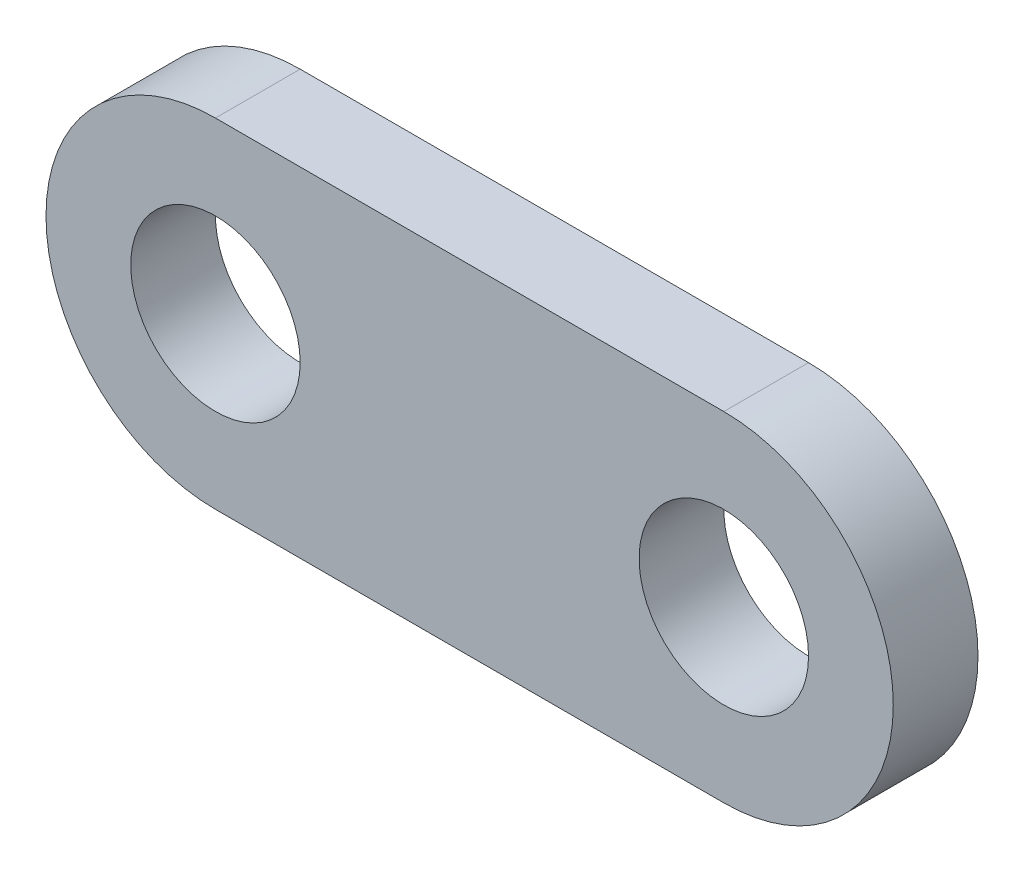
from build123d import *

# Parameters (mm, degrees)
SKETCH1_R      = 6.35
EXTRUDE1_DEPTH = 6.35


with BuildPart() as part:
    # Sketch1 → Extrude1 (new body)
    with BuildSketch(Plane.XY):
        with BuildLine():
            Line((-19.05, 12.7), (19.05, 12.7))
            ThreePointArc((19.05, 12.7), (31.75, 0), (19.05, -12.7))
            Line((19.05, -12.7), (-19.05, -12.7))
            ThreePointArc((-19.05, -12.7), (-31.75, 0), (-19.05, 12.7))
        make_face()
        with Locations((19.05, 0)):
            Circle(SKETCH1_R, mode=Mode.SUBTRACT)
        with Locations((-19.05, 0)):
            Circle(SKETCH1_R, mode=Mode.SUBTRACT)
    extrude(amount=EXTRUDE1_DEPTH)


solid = part.part
